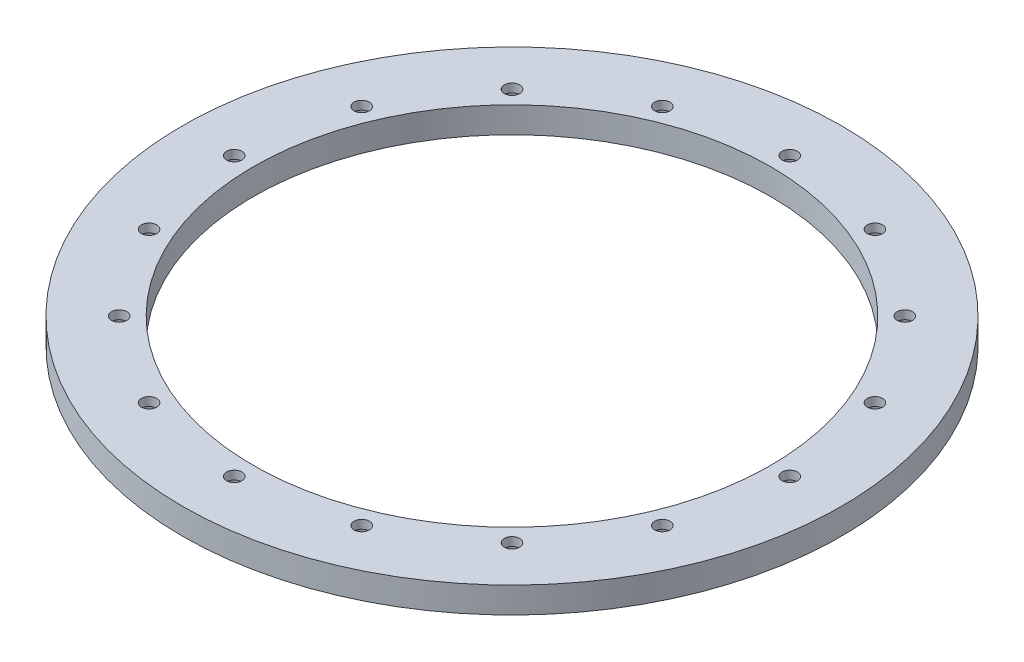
from build123d import *

# Parameters (mm, degrees)
SKETCH1_R                                       = 121.016
SKETCH1_R_2                                     = 95
BOSS_EXTRUDE1_DEPTH                             = 9.525
CBORE_FOR_10_BUTTON_HEAD_CAP_SCREW1_D           = 5.6134
CBORE_FOR_10_BUTTON_HEAD_CAP_SCREW1_CBORE_D     = 9.92124
CBORE_FOR_10_BUTTON_HEAD_CAP_SCREW1_CBORE_DEPTH = 6.3754
CIRPATTERN1_COUNT                               = 16


with BuildPart() as part:
    # Sketch1 → Boss-Extrude1 (new body)
    with BuildSketch(Plane(origin=(0, 0, 0), x_dir=(1, 0, 0), z_dir=(0, 1, 0))):
        with Locations(Location((0, 0, 0), (0, 0, 90))):
            Circle(SKETCH1_R)
        with Locations(Location((0, 0, 0), (0, 0, 90))):
            Circle(SKETCH1_R_2, mode=Mode.SUBTRACT)
    extrude(amount=BOSS_EXTRUDE1_DEPTH)

    # CBORE for _10 Button Head Cap Screw1 (through all)
    with Locations(Plane(origin=(0, 0, 0), x_dir=(-1, 0, 0), z_dir=(0, -1, 0))):
        with Locations((102, 0)):
            cbore_for_10_button_head_cap_screw1 = CounterBoreHole(CBORE_FOR_10_BUTTON_HEAD_CAP_SCREW1_D / 2, CBORE_FOR_10_BUTTON_HEAD_CAP_SCREW1_CBORE_D / 2, CBORE_FOR_10_BUTTON_HEAD_CAP_SCREW1_CBORE_DEPTH)

    # CirPattern1: CBORE for _10 Button Head Cap Screw1 ×16 about axis
    cirpattern1_axis = Axis((0, 0, 0), (0, 1, 0))
    for i in range(1, CIRPATTERN1_COUNT):
        add(cbore_for_10_button_head_cap_screw1.rotate(cirpattern1_axis, i * 360 / CIRPATTERN1_COUNT), mode=Mode.SUBTRACT)


solid = part.part
